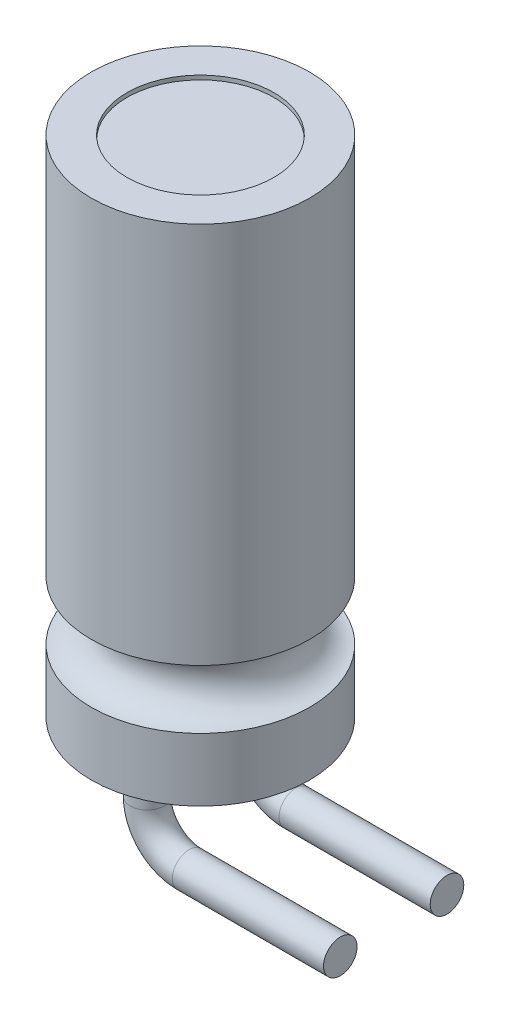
from build123d import *

# Parameters (mm, degrees)
ESQUISSE2_R             = 1.75
ENL_V_MAT_EXTRU_1_DEPTH = 0.1
ESQUISSE3_R             = 0.4


with BuildPart() as part:
    # Esquisse1 → R_volution1 (revolve)
    with BuildSketch(Plane.XY, mode=Mode.PRIVATE) as r_volution1_sk:
        with BuildLine():
            Line((0, 39.516423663), (2.6, 39.516423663))
            Line((2.6, 39.516423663), (2.6, 30.416423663))
            ThreePointArc((2.6, 30.416423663), (1.9, 29.716423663), (2.6, 29.016423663))
            Line((2.6, 29.016423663), (2.6, 27.516423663))
            Line((2.6, 27.516423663), (0, 27.516423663))
            Line((0, 27.516423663), (0, 39.516423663))
        make_face()
    revolve(r_volution1_sk.sketch.rotate(Axis((0, 48.401709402, 0), (0, -1, 0)), 90), axis=Axis((0, 48.401709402, 0), (0, -1, 0)))

    # Esquisse2 → Enl_v. mat.-Extru.1 (cut)
    with BuildSketch(Plane(origin=(0, 39.516423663, 0), x_dir=(-1, 0, 0), z_dir=(0, 1, 0))):
        with Locations(Location((0, 0, 0), (0, 0, 90))):
            Circle(ESQUISSE2_R)
    extrude(amount=-ENL_V_MAT_EXTRU_1_DEPTH, mode=Mode.SUBTRACT)

    # Balayage1: sweep along a path in Esquisse6
    with BuildLine(Plane.XY.offset(1.27)) as balayage1_path:
        Line((0, 27.516423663), (0, 26.516423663))
        ThreePointArc((0, 26.516423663), (0.292893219, 25.809316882), (1, 25.516423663))
        Line((1, 25.516423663), (4.6, 25.516423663))
    # Esquisse3 → Balayage1 (sweep)
    with BuildSketch(Plane.XZ.offset(-27.516423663)):
        with Locations((0, 1.27)):
            Circle(ESQUISSE3_R)
    balayage1 = sweep(path=balayage1_path.line)

    # Sym_trie1: Balayage1 across plane
    add(balayage1.mirror(Plane.XY))


solid = part.part
